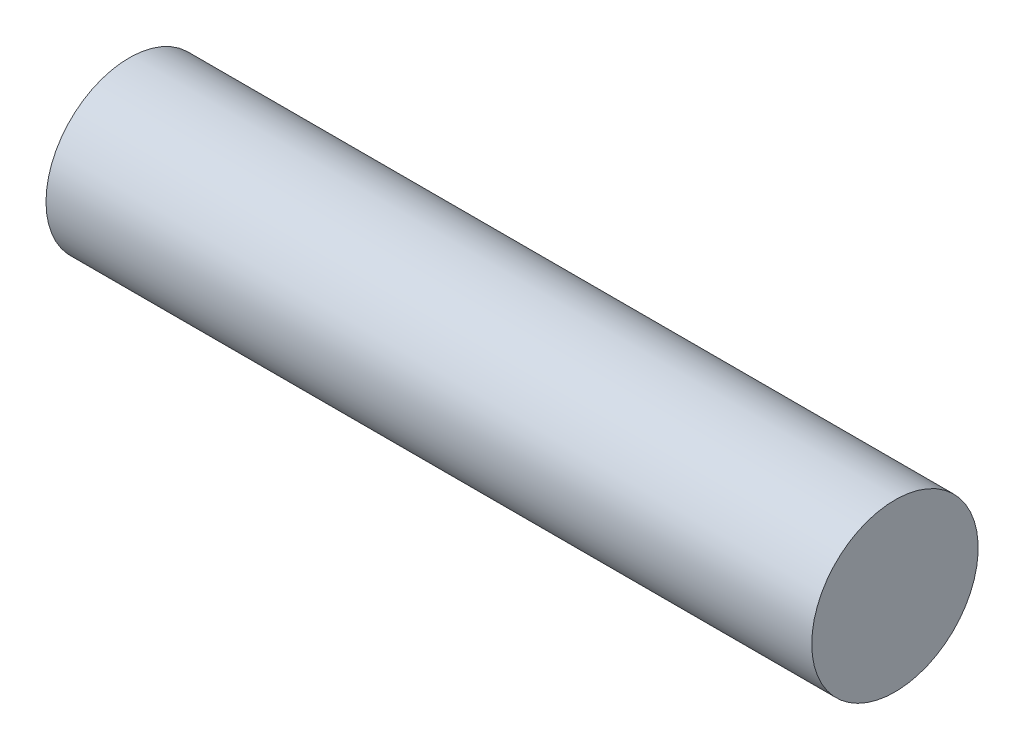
from build123d import *

# Parameters (mm, degrees)
SKETCH_1_R         = 2.825
EXTRUDE_1_DEPTH    = 26
CUT_EXTRUDE1_DEPTH = 8.67


with BuildPart() as part:
    # Sketch 1 → Extrude 1 (new body)
    with BuildSketch(Plane(origin=(0, 0, 0), x_dir=(0, 0, -1), z_dir=(1, 0, 0))):
        with Locations(Location((0, 0, 0), (0, 0, 180))):
            Circle(SKETCH_1_R)
    extrude(amount=EXTRUDE_1_DEPTH)

    # Sketch2 → Cut-Extrude1 (cut)
    with BuildSketch(Plane.ZY):
        with BuildLine():
            ThreePointArc((1.6, 0), (0.386440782, 1.552631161), (-1.413329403, 0.75))
            Line((-1.413329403, 0.75), (-1.413329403, -0.75))
            ThreePointArc((-1.413329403, -0.75), (0.386440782, -1.552631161), (1.6, 0))
        make_face()
    extrude(amount=-CUT_EXTRUDE1_DEPTH, mode=Mode.SUBTRACT)


solid = part.part
